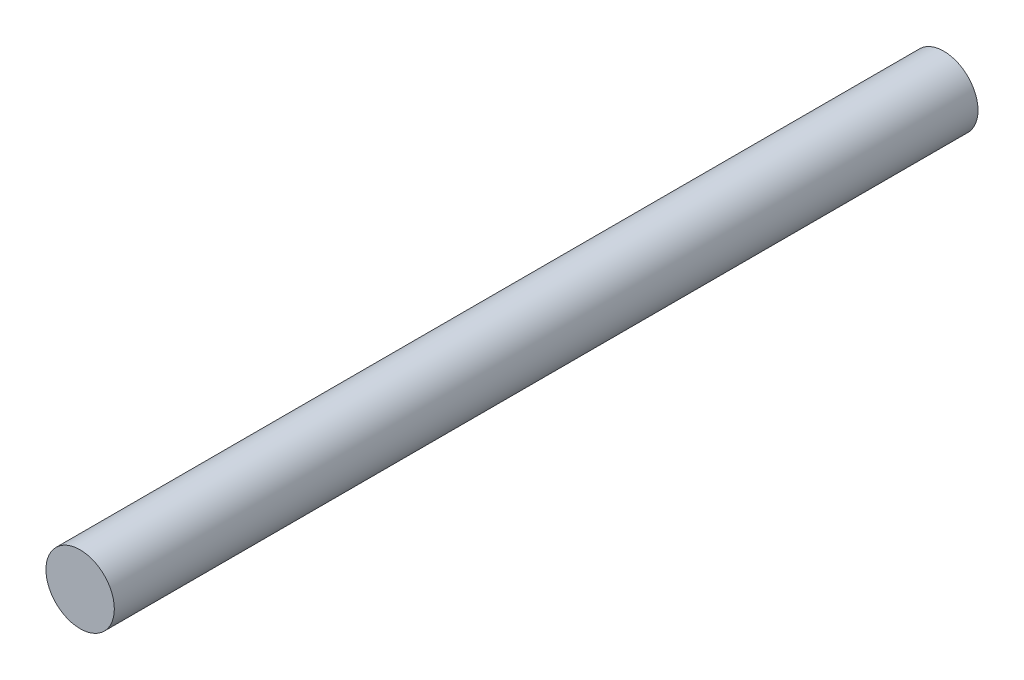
ISO-10303-21;
HEADER;
FILE_DESCRIPTION(('STEP AP214'),'2;1');
FILE_NAME('part.step','',(''),(''),'','','');
FILE_SCHEMA(('AUTOMOTIVE_DESIGN { 1 0 10303 214 1 1 1 1 }'));
ENDSEC;
DATA;
#1=APPLICATION_CONTEXT('core data for automotive mechanical design processes');
#2=APPLICATION_PROTOCOL_DEFINITION('international standard','automotive_design',2000,#1);
#3=PRODUCT_CONTEXT('',#1,'mechanical');
#4=PRODUCT('Part','Part','',(#3));
#5=PRODUCT_RELATED_PRODUCT_CATEGORY('part','',(#4));
#6=PRODUCT_DEFINITION_FORMATION('','',#4);
#7=PRODUCT_DEFINITION_CONTEXT('part definition',#1,'design');
#8=PRODUCT_DEFINITION('design','',#6,#7);
#9=PRODUCT_DEFINITION_SHAPE('','',#8);
#10=(LENGTH_UNIT() NAMED_UNIT(*) SI_UNIT(.MILLI.,.METRE.));
#11=(NAMED_UNIT(*) PLANE_ANGLE_UNIT() SI_UNIT($,.RADIAN.));
#12=(NAMED_UNIT(*) SI_UNIT($,.STERADIAN.) SOLID_ANGLE_UNIT());
#13=UNCERTAINTY_MEASURE_WITH_UNIT(LENGTH_MEASURE(1.E-05),#10,'distance_accuracy_value','');
#14=(GEOMETRIC_REPRESENTATION_CONTEXT(3) GLOBAL_UNCERTAINTY_ASSIGNED_CONTEXT((#13)) GLOBAL_UNIT_ASSIGNED_CONTEXT((#10,
#11,#12)) REPRESENTATION_CONTEXT('',''));
#15=CARTESIAN_POINT('',(0.,0.,0.));
#16=DIRECTION('',(0.,0.,1.));
#17=DIRECTION('',(1.,0.,0.));
#18=AXIS2_PLACEMENT_3D('',#15,#16,#17);
#19=CARTESIAN_POINT('',(0.,0.,37.88));
#20=DIRECTION('',(0.,0.,-1.));
#21=DIRECTION('',(-1.,0.,0.));
#22=AXIS2_PLACEMENT_3D('',#19,#20,#21);
#23=CYLINDRICAL_SURFACE('',#22,1.5);
#24=CARTESIAN_POINT('',(0.,0.,37.88));
#25=DIRECTION('',(0.,0.,1.));
#26=DIRECTION('',(1.,0.,0.));
#27=AXIS2_PLACEMENT_3D('',#24,#25,#26);
#28=CIRCLE('',#27,1.5);
#29=CARTESIAN_POINT('',(1.5,0.,37.88));
#30=VERTEX_POINT('',#29);
#31=EDGE_CURVE('E8',#30,#30,#28,.T.);
#32=ORIENTED_EDGE('',*,*,#31,.F.);
#33=EDGE_LOOP('',(#32));
#34=FACE_BOUND('',#33,.T.);
#35=CARTESIAN_POINT('',(0.,0.,0.));
#36=DIRECTION('',(0.,0.,1.));
#37=DIRECTION('',(1.,0.,0.));
#38=AXIS2_PLACEMENT_3D('',#35,#36,#37);
#39=CIRCLE('',#38,1.5);
#40=CARTESIAN_POINT('',(1.5,0.,0.));
#41=VERTEX_POINT('',#40);
#42=EDGE_CURVE('E15',#41,#41,#39,.T.);
#43=ORIENTED_EDGE('',*,*,#42,.T.);
#44=EDGE_LOOP('',(#43));
#45=FACE_BOUND('',#44,.T.);
#46=ADVANCED_FACE('F12',(#34,#45),#23,.T.);
#47=CARTESIAN_POINT('',(0.,0.,37.88));
#48=DIRECTION('',(0.,0.,1.));
#49=DIRECTION('',(1.,0.,0.));
#50=AXIS2_PLACEMENT_3D('',#47,#48,#49);
#51=PLANE('',#50);
#52=ORIENTED_EDGE('',*,*,#31,.T.);
#53=EDGE_LOOP('',(#52));
#54=FACE_BOUND('',#53,.T.);
#55=ADVANCED_FACE('F27',(#54),#51,.T.);
#56=CARTESIAN_POINT('',(0.,0.,0.));
#57=DIRECTION('',(0.,0.,1.));
#58=DIRECTION('',(1.,0.,0.));
#59=AXIS2_PLACEMENT_3D('',#56,#57,#58);
#60=PLANE('',#59);
#61=ORIENTED_EDGE('',*,*,#42,.F.);
#62=EDGE_LOOP('',(#61));
#63=FACE_BOUND('',#62,.T.);
#64=ADVANCED_FACE('F25',(#63),#60,.F.);
#65=CLOSED_SHELL('',(#46,#55,#64));
#66=MANIFOLD_SOLID_BREP('B1',#65);
#67=ADVANCED_BREP_SHAPE_REPRESENTATION('',(#18,#66),#14);
#68=SHAPE_DEFINITION_REPRESENTATION(#9,#67);
ENDSEC;
END-ISO-10303-21;
